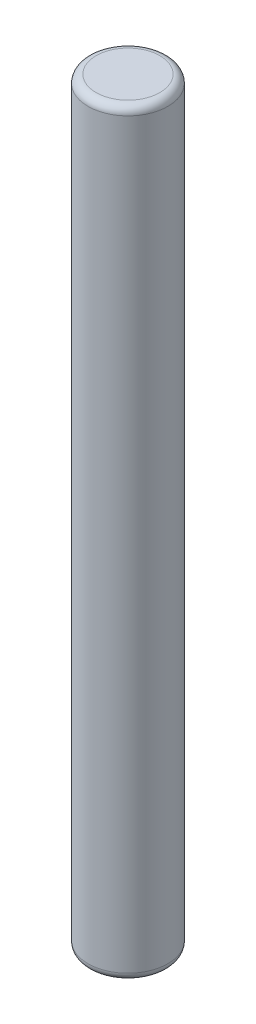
from build123d import *

# Parameters (mm, degrees)
SKETCH1_R           = 2.5
BOSS_EXTRUDE1_DEPTH = 47.5
FILLET1_R           = 0.5


with BuildPart() as part:
    # Sketch1 → Boss-Extrude1 (new body)
    with BuildSketch(Plane(origin=(0, 0, 0), x_dir=(1, 0, 0), z_dir=(0, 1, 0))):
        with Locations(Location((0, 0, 0), (0, 0, 270))):
            Circle(SKETCH1_R)
    extrude(amount=BOSS_EXTRUDE1_DEPTH)

    # Fillet1
    fillet1_edges = [part.edges().sort_by_distance(p)[0] for p in [
        (0, 0, -2.5),
        (0, 47.5, -2.5),
    ]]
    fillet(fillet1_edges, radius=FILLET1_R)


solid = part.part
